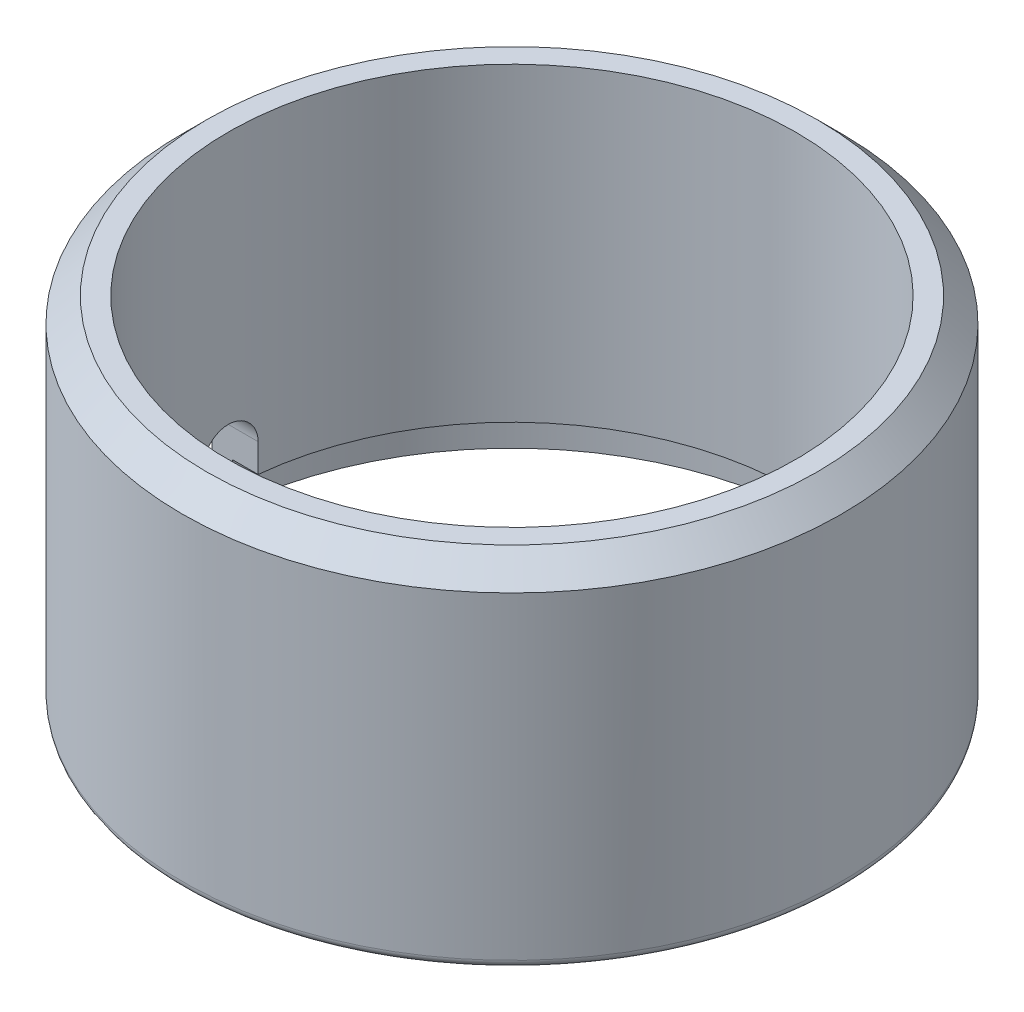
from build123d import *

# Parameters (mm, degrees)
SKETCH1_R           = 20.3
BOSS_EXTRUDE1_DEPTH = 21.6
SKETCH3_R           = 17.475
CUT_EXTRUDE1_DEPTH  = 36.926870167
CHAMFER1_SIZE       = 1.5
SKETCH4_R           = 19.05
CUT_EXTRUDE2_DEPTH  = 2.5
FILLET1_R           = 0.5
CUT_EXTRUDE4_REACH  = 52.269


with BuildPart() as part:
    # Sketch1 → Boss-Extrude1 (new body)
    with BuildSketch(Plane(origin=(0, 0, 0), x_dir=(1, 0, 0), z_dir=(0, 1, 0))):
        with Locations(Location((0, 0, 0), (0, 0, 90))):
            Circle(SKETCH1_R)
    extrude(amount=BOSS_EXTRUDE1_DEPTH)

    # Sketch3 → Cut-Extrude1 (cut, through all)
    with BuildSketch(Plane.XZ):
        with Locations(Location((0, 0, 0), (0, 0, 270))):
            Circle(SKETCH3_R)
    extrude(amount=-CUT_EXTRUDE1_DEPTH, mode=Mode.SUBTRACT)

    # Chamfer1
    chamfer1_edges = [part.edges().sort_by_distance(p)[0] for p in [
        (0, 21.6, 20.3),
    ]]
    chamfer(chamfer1_edges, length=CHAMFER1_SIZE)

    # Sketch4 → Cut-Extrude2 (cut)
    with BuildSketch(Plane.XZ):
        with Locations(Location((0, 0, 0), (0, 0, 270))):
            Circle(SKETCH4_R)
    extrude(amount=-CUT_EXTRUDE2_DEPTH, mode=Mode.SUBTRACT)

    # Fillet1
    fillet1_edges = [part.edges().sort_by_distance(p)[0] for p in [
        (0, 0, 20.3),
    ]]
    fillet(fillet1_edges, radius=FILLET1_R)

    # Sketch8 → Cut-Extrude4 (cut, up to next)
    with BuildSketch(Plane.ZY.offset(20.3), mode=Mode.PRIVATE) as cut_extrude4_sk1:
        with BuildLine():
            Line((1.75, 0), (-1.75, 0))
            Line((-1.75, 0), (-1.75, 4.25))
            ThreePointArc((-1.75, 4.25), (-1.237436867, 5.487436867), (0, 6))
            Line((0, 6), (0.005, 6))
            ThreePointArc((0.005, 6), (1.238901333, 5.488901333), (1.75, 4.255))
            Line((1.75, 4.255), (1.75, 0))
        make_face()
    cut_extrude4_tool1 = extrude(cut_extrude4_sk1.sketch, amount=-CUT_EXTRUDE4_REACH, mode=Mode.PRIVATE) & part.part
    add(cut_extrude4_tool1.solids().sort_by_distance((-20.3, 2.826279, 0.000222))[0], mode=Mode.SUBTRACT)


solid = part.part
